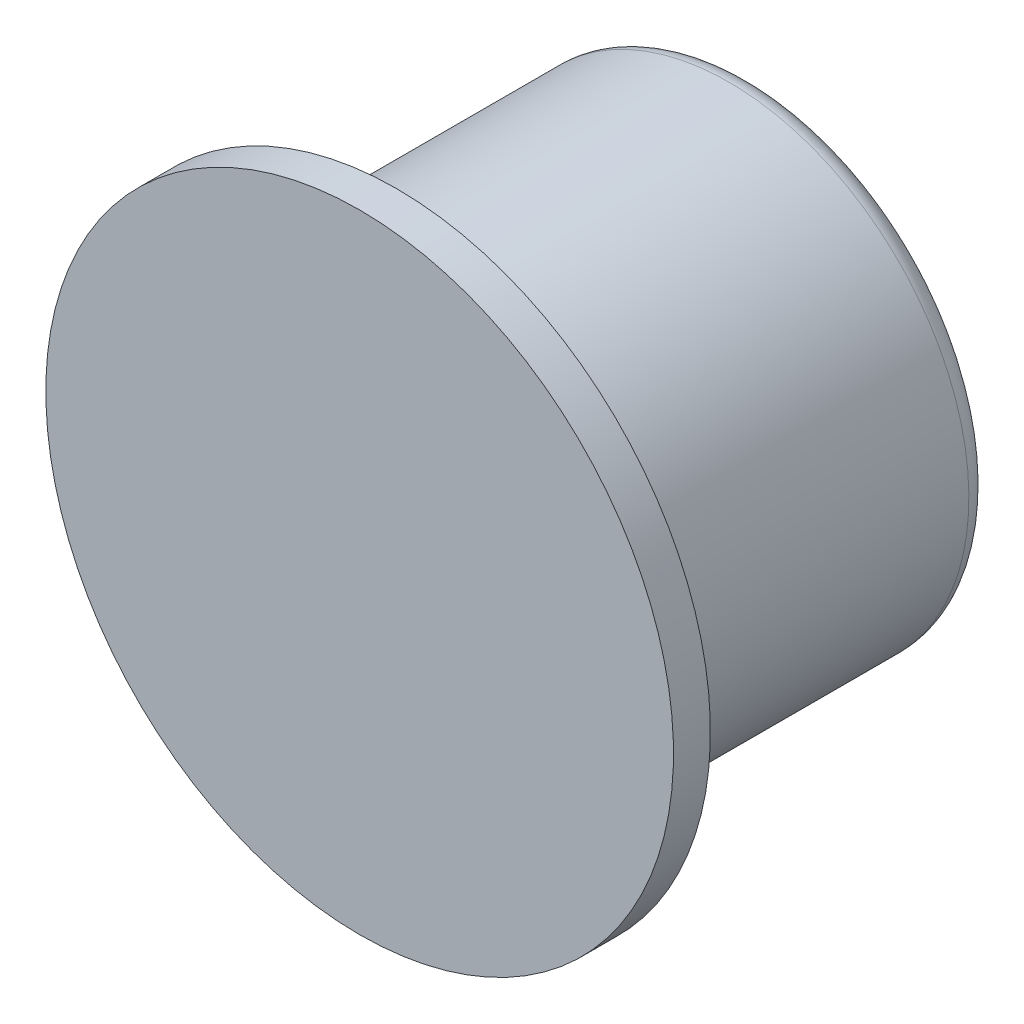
from build123d import *


with BuildPart() as part:
    # Sketch1 → Revolve1 (revolve)
    with BuildSketch(Plane(origin=(0, 0, 0), x_dir=(0, 0, -1), z_dir=(1, 0, 0)), mode=Mode.PRIVATE) as revolve1_sk:
        with BuildLine():
            Line((0, 0), (0, 42.5))
            Line((0, 42.5), (5, 42.5))
            Line((5, 42.5), (5, 32.5))
            Line((5, 32.5), (50, 32.5))
            ThreePointArc((50, 32.5), (52.121320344, 31.621320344), (53, 29.5))
            Line((53, 29.5), (53, 4.5))
            Line((53, 4.5), (52.5, 4))
            Line((52.5, 4), (44, 4))
            Line((44, 4), (41.690598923, 0))
            Line((41.690598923, 0), (0, 0))
        make_face()
    revolve(revolve1_sk.sketch.rotate(Axis((0, 0, 0), (0, 0, -1)), 180), axis=Axis((0, 0, 0), (0, 0, -1)))


solid = part.part
